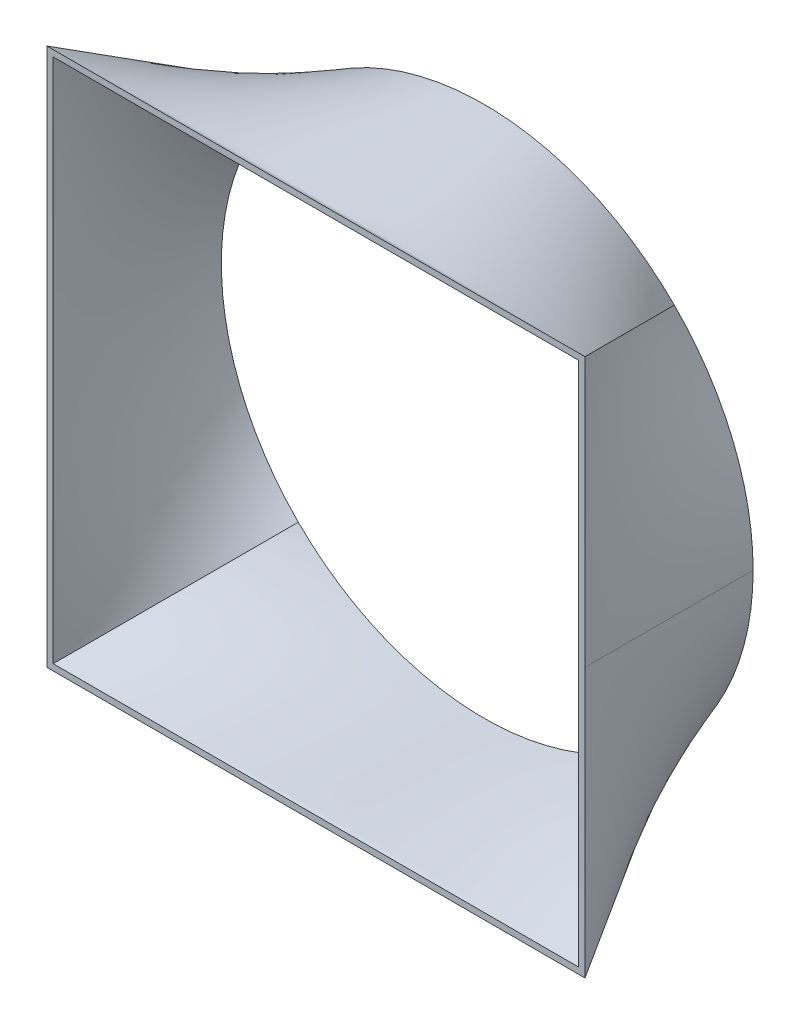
ISO-10303-21;
HEADER;
FILE_DESCRIPTION(('STEP AP214'),'2;1');
FILE_NAME('part.step','',(''),(''),'','','');
FILE_SCHEMA(('AUTOMOTIVE_DESIGN { 1 0 10303 214 1 1 1 1 }'));
ENDSEC;
DATA;
#1=APPLICATION_CONTEXT('core data for automotive mechanical design processes');
#2=APPLICATION_PROTOCOL_DEFINITION('international standard','automotive_design',2000,#1);
#3=PRODUCT_CONTEXT('',#1,'mechanical');
#4=PRODUCT('Part','Part','',(#3));
#5=PRODUCT_RELATED_PRODUCT_CATEGORY('part','',(#4));
#6=PRODUCT_DEFINITION_FORMATION('','',#4);
#7=PRODUCT_DEFINITION_CONTEXT('part definition',#1,'design');
#8=PRODUCT_DEFINITION('design','',#6,#7);
#9=PRODUCT_DEFINITION_SHAPE('','',#8);
#10=(LENGTH_UNIT() NAMED_UNIT(*) SI_UNIT(.MILLI.,.METRE.));
#11=(NAMED_UNIT(*) PLANE_ANGLE_UNIT() SI_UNIT($,.RADIAN.));
#12=(NAMED_UNIT(*) SI_UNIT($,.STERADIAN.) SOLID_ANGLE_UNIT());
#13=UNCERTAINTY_MEASURE_WITH_UNIT(LENGTH_MEASURE(1.E-05),#10,'distance_accuracy_value','');
#14=(GEOMETRIC_REPRESENTATION_CONTEXT(3) GLOBAL_UNCERTAINTY_ASSIGNED_CONTEXT((#13)) GLOBAL_UNIT_ASSIGNED_CONTEXT((#10,
#11,#12)) REPRESENTATION_CONTEXT('',''));
#15=CARTESIAN_POINT('',(0.,0.,0.));
#16=DIRECTION('',(0.,0.,1.));
#17=DIRECTION('',(1.,0.,0.));
#18=AXIS2_PLACEMENT_3D('',#15,#16,#17);
#19=CARTESIAN_POINT('',(88.388347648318,-88.38834764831,0.));
#20=CARTESIAN_POINT('',(125.,-125.,80.));
#21=CARTESIAN_POINT('',(98.30549706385,-78.47119823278,0.));
#22=CARTESIAN_POINT('',(125.,-107.1428571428,80.));
#23=CARTESIAN_POINT('',(106.92449391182,-67.25589665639,0.));
#24=CARTESIAN_POINT('',(125.,-89.28571428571,80.));
#25=CARTESIAN_POINT('',(114.04143049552,-54.94635869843,0.));
#26=CARTESIAN_POINT('',(125.,-71.42857142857,80.));
#27=CARTESIAN_POINT('',(119.49241167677,-41.78652600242,0.));
#28=CARTESIAN_POINT('',(125.,-53.57142857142,80.));
#29=CARTESIAN_POINT('',(123.1641353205,-28.04993411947,0.));
#30=CARTESIAN_POINT('',(125.,-35.71428571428,80.));
#31=CARTESIAN_POINT('',(125.,-14.02496720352,0.));
#32=CARTESIAN_POINT('',(125.,-17.85714285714,80.));
#33=CARTESIAN_POINT('',(125.,0.,0.));
#34=CARTESIAN_POINT('',(125.,0.,80.));
#35=(BOUNDED_SURFACE() B_SPLINE_SURFACE(7,1,((#19,#20),(#21,#22),(#23,#24),(#25,#26),(#27,#28),
(#29,#30),(#31,#32),(#33,#34)),.UNSPECIFIED.,.F.,.F.,.F.) B_SPLINE_SURFACE_WITH_KNOTS((8,8),(2,
2),(0.,125.),(0.,1.),
.UNSPECIFIED.) GEOMETRIC_REPRESENTATION_ITEM() RATIONAL_B_SPLINE_SURFACE(((1.,1.),(1.,1.),(1.,
1.),(1.,1.),(1.,1.),(1.,1.),(1.,1.),(1.,1.))) REPRESENTATION_ITEM('') SURFACE());
#36=CARTESIAN_POINT('',(88.388347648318,-88.38834764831,0.));
#37=CARTESIAN_POINT('',(125.,-125.,80.));
#38=(BOUNDED_CURVE() B_SPLINE_CURVE(1,(#36,#37),.UNSPECIFIED.,.F.,
.F.) B_SPLINE_CURVE_WITH_KNOTS((2,2),(0.,1.),
.UNSPECIFIED.) CURVE() GEOMETRIC_REPRESENTATION_ITEM() RATIONAL_B_SPLINE_CURVE((1.,1.)) REPRESENTATION_ITEM(''));
#39=CARTESIAN_POINT('',(88.388347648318,-88.38834764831,0.));
#40=VERTEX_POINT('',#39);
#41=CARTESIAN_POINT('',(125.,-125.,80.));
#42=VERTEX_POINT('',#41);
#43=EDGE_CURVE('E10',#40,#42,#38,.T.);
#44=DIRECTION('',(0.,1.,0.));
#45=VECTOR('',#44,1.);
#46=CARTESIAN_POINT('',(125.,-125.,80.));
#47=LINE('',#46,#45);
#48=CARTESIAN_POINT('',(125.,0.,80.));
#49=VERTEX_POINT('',#48);
#50=EDGE_CURVE('E139',#42,#49,#47,.T.);
#51=CARTESIAN_POINT('',(125.,0.,0.));
#52=CARTESIAN_POINT('',(125.,0.,80.));
#53=(BOUNDED_CURVE() B_SPLINE_CURVE(1,(#51,#52),.UNSPECIFIED.,.F.,
.F.) B_SPLINE_CURVE_WITH_KNOTS((2,2),(0.,1.),
.UNSPECIFIED.) CURVE() GEOMETRIC_REPRESENTATION_ITEM() RATIONAL_B_SPLINE_CURVE((1.,1.)) REPRESENTATION_ITEM(''));
#54=CARTESIAN_POINT('',(125.,0.,0.));
#55=VERTEX_POINT('',#54);
#56=EDGE_CURVE('E124',#55,#49,#53,.T.);
#57=CARTESIAN_POINT('',(0.,0.,0.));
#58=DIRECTION('',(0.,0.,1.));
#59=DIRECTION('',(1.,0.,0.));
#60=AXIS2_PLACEMENT_3D('',#57,#58,#59);
#61=CIRCLE('',#60,125.);
#62=EDGE_CURVE('E161',#40,#55,#61,.T.);
#63=ORIENTED_EDGE('',*,*,#43,.T.);
#64=ORIENTED_EDGE('',*,*,#50,.T.);
#65=ORIENTED_EDGE('',*,*,#56,.F.);
#66=ORIENTED_EDGE('',*,*,#62,.F.);
#67=EDGE_LOOP('',(#63,#64,#65,#66));
#68=FACE_BOUND('',#67,.T.);
#69=ADVANCED_FACE('F16',(#68),#35,.F.);
#70=CARTESIAN_POINT('',(-88.38834764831,-88.38834764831,0.));
#71=CARTESIAN_POINT('',(-125.,-125.,80.));
#72=CARTESIAN_POINT('',(-72.96167077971,-103.8150245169,0.));
#73=CARTESIAN_POINT('',(-97.22222222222,-125.,80.));
#74=CARTESIAN_POINT('',(-54.50597301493,-116.2126809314,0.));
#75=CARTESIAN_POINT('',(-69.44444444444,-125.,80.));
#76=CARTESIAN_POINT('',(-33.70096481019,-124.9016021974,0.));
#77=CARTESIAN_POINT('',(-41.66666666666,-125.,80.));
#78=CARTESIAN_POINT('',(-11.40430607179,-129.3800423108,0.));
#79=CARTESIAN_POINT('',(-13.88888888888,-125.,80.));
#80=CARTESIAN_POINT('',(11.404306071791,-129.3800423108,0.));
#81=CARTESIAN_POINT('',(13.888888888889,-125.,80.));
#82=CARTESIAN_POINT('',(33.700964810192,-124.9016021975,0.));
#83=CARTESIAN_POINT('',(41.666666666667,-125.,80.));
#84=CARTESIAN_POINT('',(54.505973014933,-116.2126809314,0.));
#85=CARTESIAN_POINT('',(69.444444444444,-125.,80.));
#86=CARTESIAN_POINT('',(72.961670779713,-103.8150245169,0.));
#87=CARTESIAN_POINT('',(97.222222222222,-125.,80.));
#88=CARTESIAN_POINT('',(88.388347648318,-88.38834764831,0.));
#89=CARTESIAN_POINT('',(125.,-125.,80.));
#90=(BOUNDED_SURFACE() B_SPLINE_SURFACE(9,1,((#70,#71),(#72,#73),(#74,#75),(#76,#77),(#78,#79),
(#80,#81),(#82,#83),(#84,#85),(#86,#87),(#88,#89)),.UNSPECIFIED.,.F.,.F.,
.F.) B_SPLINE_SURFACE_WITH_KNOTS((10,10),(2,2),(0.,250.),(0.,1.),
.UNSPECIFIED.) GEOMETRIC_REPRESENTATION_ITEM() RATIONAL_B_SPLINE_SURFACE(((1.,1.),(1.,1.),(1.,
1.),(1.,1.),(1.,1.),(1.,1.),(1.,1.),(1.,1.),(1.,1.),(1.,1.))) REPRESENTATION_ITEM('') SURFACE());
#91=CARTESIAN_POINT('',(-88.38834764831,-88.38834764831,0.));
#92=CARTESIAN_POINT('',(-125.,-125.,80.));
#93=(BOUNDED_CURVE() B_SPLINE_CURVE(1,(#91,#92),.UNSPECIFIED.,.F.,
.F.) B_SPLINE_CURVE_WITH_KNOTS((2,2),(0.,1.),
.UNSPECIFIED.) CURVE() GEOMETRIC_REPRESENTATION_ITEM() RATIONAL_B_SPLINE_CURVE((1.,1.)) REPRESENTATION_ITEM(''));
#94=CARTESIAN_POINT('',(-88.38834764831,-88.38834764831,0.));
#95=VERTEX_POINT('',#94);
#96=CARTESIAN_POINT('',(-125.,-125.,80.));
#97=VERTEX_POINT('',#96);
#98=EDGE_CURVE('E22',#95,#97,#93,.T.);
#99=DIRECTION('',(1.,0.,0.));
#100=VECTOR('',#99,1.);
#101=CARTESIAN_POINT('',(-125.,-125.,80.));
#102=LINE('',#101,#100);
#103=EDGE_CURVE('E143',#97,#42,#102,.T.);
#104=CARTESIAN_POINT('',(0.,0.,0.));
#105=DIRECTION('',(0.,0.,1.));
#106=DIRECTION('',(1.,0.,0.));
#107=AXIS2_PLACEMENT_3D('',#104,#105,#106);
#108=CIRCLE('',#107,125.);
#109=EDGE_CURVE('E211',#95,#40,#108,.T.);
#110=ORIENTED_EDGE('',*,*,#98,.T.);
#111=ORIENTED_EDGE('',*,*,#103,.T.);
#112=ORIENTED_EDGE('',*,*,#43,.F.);
#113=ORIENTED_EDGE('',*,*,#109,.F.);
#114=EDGE_LOOP('',(#110,#111,#112,#113));
#115=FACE_BOUND('',#114,.T.);
#116=ADVANCED_FACE('F18',(#115),#90,.F.);
#117=CARTESIAN_POINT('',(-88.38834764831,88.388347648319,0.));
#118=CARTESIAN_POINT('',(-125.,125.,80.));
#119=CARTESIAN_POINT('',(-103.8150245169,72.961670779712,0.));
#120=CARTESIAN_POINT('',(-125.,97.222222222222,80.));
#121=CARTESIAN_POINT('',(-116.2126809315,54.505973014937,0.));
#122=CARTESIAN_POINT('',(-125.,69.444444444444,80.));
#123=CARTESIAN_POINT('',(-124.9016021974,33.700964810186,0.));
#124=CARTESIAN_POINT('',(-125.,41.666666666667,80.));
#125=CARTESIAN_POINT('',(-129.3800423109,11.404306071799,0.));
#126=CARTESIAN_POINT('',(-125.,13.888888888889,80.));
#127=CARTESIAN_POINT('',(-129.3800423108,-11.40430607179,0.));
#128=CARTESIAN_POINT('',(-125.,-13.88888888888,80.));
#129=CARTESIAN_POINT('',(-124.9016021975,-33.70096481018,0.));
#130=CARTESIAN_POINT('',(-125.,-41.66666666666,80.));
#131=CARTESIAN_POINT('',(-116.2126809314,-54.50597301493,0.));
#132=CARTESIAN_POINT('',(-125.,-69.44444444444,80.));
#133=CARTESIAN_POINT('',(-103.8150245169,-72.96167077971,0.));
#134=CARTESIAN_POINT('',(-125.,-97.22222222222,80.));
#135=CARTESIAN_POINT('',(-88.38834764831,-88.38834764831,0.));
#136=CARTESIAN_POINT('',(-125.,-125.,80.));
#137=(BOUNDED_SURFACE() B_SPLINE_SURFACE(9,1,((#117,#118),(#119,#120),(#121,#122),(#123,#124),
(#125,#126),(#127,#128),(#129,#130),(#131,#132),(#133,#134),(#135,#136)),.UNSPECIFIED.,.F.,.F.,
.F.) B_SPLINE_SURFACE_WITH_KNOTS((10,10),(2,2),(0.,250.),(0.,1.),
.UNSPECIFIED.) GEOMETRIC_REPRESENTATION_ITEM() RATIONAL_B_SPLINE_SURFACE(((1.,1.),(1.,1.),(1.,
1.),(1.,1.),(1.,1.),(1.,1.),(1.,1.),(1.,1.),(1.,1.),(1.,1.))) REPRESENTATION_ITEM('') SURFACE());
#138=CARTESIAN_POINT('',(-88.38834764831,88.388347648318,0.));
#139=CARTESIAN_POINT('',(-125.,125.,80.));
#140=(BOUNDED_CURVE() B_SPLINE_CURVE(1,(#138,#139),.UNSPECIFIED.,.F.,
.F.) B_SPLINE_CURVE_WITH_KNOTS((2,2),(0.,1.),
.UNSPECIFIED.) CURVE() GEOMETRIC_REPRESENTATION_ITEM() RATIONAL_B_SPLINE_CURVE((1.,1.)) REPRESENTATION_ITEM(''));
#141=CARTESIAN_POINT('',(-88.38834764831,88.388347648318,0.));
#142=VERTEX_POINT('',#141);
#143=CARTESIAN_POINT('',(-125.,125.,80.));
#144=VERTEX_POINT('',#143);
#145=EDGE_CURVE('E42',#142,#144,#140,.T.);
#146=DIRECTION('',(0.,-1.,0.));
#147=VECTOR('',#146,1.);
#148=CARTESIAN_POINT('',(-125.,125.,80.));
#149=LINE('',#148,#147);
#150=EDGE_CURVE('E217',#144,#97,#149,.T.);
#151=CARTESIAN_POINT('',(0.,0.,0.));
#152=DIRECTION('',(0.,0.,1.));
#153=DIRECTION('',(1.,0.,0.));
#154=AXIS2_PLACEMENT_3D('',#151,#152,#153);
#155=CIRCLE('',#154,125.);
#156=EDGE_CURVE('E204',#142,#95,#155,.T.);
#157=ORIENTED_EDGE('',*,*,#145,.T.);
#158=ORIENTED_EDGE('',*,*,#150,.T.);
#159=ORIENTED_EDGE('',*,*,#98,.F.);
#160=ORIENTED_EDGE('',*,*,#156,.F.);
#161=EDGE_LOOP('',(#157,#158,#159,#160));
#162=FACE_BOUND('',#161,.T.);
#163=ADVANCED_FACE('F322',(#162),#137,.F.);
#164=CARTESIAN_POINT('',(88.388347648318,88.388347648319,0.));
#165=CARTESIAN_POINT('',(125.,125.,80.));
#166=CARTESIAN_POINT('',(72.961670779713,103.81502451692,0.));
#167=CARTESIAN_POINT('',(97.222222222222,125.,80.));
#168=CARTESIAN_POINT('',(54.505973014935,116.2126809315,0.));
#169=CARTESIAN_POINT('',(69.444444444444,125.,80.));
#170=CARTESIAN_POINT('',(33.700964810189,124.90160219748,0.));
#171=CARTESIAN_POINT('',(41.666666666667,125.,80.));
#172=CARTESIAN_POINT('',(11.404306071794,129.3800423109,0.));
#173=CARTESIAN_POINT('',(13.888888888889,125.,80.));
#174=CARTESIAN_POINT('',(-11.40430607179,129.38004231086,0.));
#175=CARTESIAN_POINT('',(-13.88888888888,125.,80.));
#176=CARTESIAN_POINT('',(-33.70096481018,124.90160219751,0.));
#177=CARTESIAN_POINT('',(-41.66666666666,125.,80.));
#178=CARTESIAN_POINT('',(-54.50597301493,116.21268093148,0.));
#179=CARTESIAN_POINT('',(-69.44444444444,125.,80.));
#180=CARTESIAN_POINT('',(-72.96167077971,103.81502451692,0.));
#181=CARTESIAN_POINT('',(-97.22222222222,125.,80.));
#182=CARTESIAN_POINT('',(-88.38834764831,88.388347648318,0.));
#183=CARTESIAN_POINT('',(-125.,125.,80.));
#184=(BOUNDED_SURFACE() B_SPLINE_SURFACE(9,1,((#164,#165),(#166,#167),(#168,#169),(#170,#171),
(#172,#173),(#174,#175),(#176,#177),(#178,#179),(#180,#181),(#182,#183)),.UNSPECIFIED.,.F.,.F.,
.F.) B_SPLINE_SURFACE_WITH_KNOTS((10,10),(2,2),(0.,250.),(0.,1.),
.UNSPECIFIED.) GEOMETRIC_REPRESENTATION_ITEM() RATIONAL_B_SPLINE_SURFACE(((1.,1.),(1.,1.),(1.,
1.),(1.,1.),(1.,1.),(1.,1.),(1.,1.),(1.,1.),(1.,1.),(1.,1.))) REPRESENTATION_ITEM('') SURFACE());
#185=CARTESIAN_POINT('',(88.388347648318,88.388347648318,0.));
#186=CARTESIAN_POINT('',(125.,125.,80.));
#187=(BOUNDED_CURVE() B_SPLINE_CURVE(1,(#185,#186),.UNSPECIFIED.,.F.,
.F.) B_SPLINE_CURVE_WITH_KNOTS((2,2),(0.,1.),
.UNSPECIFIED.) CURVE() GEOMETRIC_REPRESENTATION_ITEM() RATIONAL_B_SPLINE_CURVE((1.,1.)) REPRESENTATION_ITEM(''));
#188=CARTESIAN_POINT('',(88.388347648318,88.388347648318,0.));
#189=VERTEX_POINT('',#188);
#190=CARTESIAN_POINT('',(125.,125.,80.));
#191=VERTEX_POINT('',#190);
#192=EDGE_CURVE('E135',#189,#191,#187,.T.);
#193=DIRECTION('',(-1.,0.,0.));
#194=VECTOR('',#193,1.);
#195=CARTESIAN_POINT('',(125.,125.,80.));
#196=LINE('',#195,#194);
#197=EDGE_CURVE('E149',#191,#144,#196,.T.);
#198=CARTESIAN_POINT('',(0.,0.,0.));
#199=DIRECTION('',(0.,0.,1.));
#200=DIRECTION('',(1.,0.,0.));
#201=AXIS2_PLACEMENT_3D('',#198,#199,#200);
#202=CIRCLE('',#201,125.);
#203=EDGE_CURVE('E200',#189,#142,#202,.T.);
#204=ORIENTED_EDGE('',*,*,#192,.T.);
#205=ORIENTED_EDGE('',*,*,#197,.T.);
#206=ORIENTED_EDGE('',*,*,#145,.F.);
#207=ORIENTED_EDGE('',*,*,#203,.F.);
#208=EDGE_LOOP('',(#204,#205,#206,#207));
#209=FACE_BOUND('',#208,.T.);
#210=ADVANCED_FACE('F327',(#209),#184,.F.);
#211=CARTESIAN_POINT('',(125.,0.,0.));
#212=CARTESIAN_POINT('',(125.,0.,80.));
#213=CARTESIAN_POINT('',(125.,14.024967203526,0.));
#214=CARTESIAN_POINT('',(125.,17.857142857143,80.));
#215=CARTESIAN_POINT('',(123.1641353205,28.049934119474,0.));
#216=CARTESIAN_POINT('',(125.,35.714285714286,80.));
#217=CARTESIAN_POINT('',(119.49241167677,41.786526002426,0.));
#218=CARTESIAN_POINT('',(125.,53.571428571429,80.));
#219=CARTESIAN_POINT('',(114.04143049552,54.946358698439,0.));
#220=CARTESIAN_POINT('',(125.,71.428571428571,80.));
#221=CARTESIAN_POINT('',(106.92449391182,67.255896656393,0.));
#222=CARTESIAN_POINT('',(125.,89.285714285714,80.));
#223=CARTESIAN_POINT('',(98.305497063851,78.471198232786,0.));
#224=CARTESIAN_POINT('',(125.,107.14285714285,80.));
#225=CARTESIAN_POINT('',(88.388347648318,88.388347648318,0.));
#226=CARTESIAN_POINT('',(125.,125.,80.));
#227=(BOUNDED_SURFACE() B_SPLINE_SURFACE(7,1,((#211,#212),(#213,#214),(#215,#216),(#217,#218),
(#219,#220),(#221,#222),(#223,#224),(#225,#226)),.UNSPECIFIED.,.F.,.F.,
.F.) B_SPLINE_SURFACE_WITH_KNOTS((8,8),(2,2),(125.,250.),(0.,1.),
.UNSPECIFIED.) GEOMETRIC_REPRESENTATION_ITEM() RATIONAL_B_SPLINE_SURFACE(((1.,1.),(1.,1.),(1.,
1.),(1.,1.),(1.,1.),(1.,1.),(1.,1.),(1.,1.))) REPRESENTATION_ITEM('') SURFACE());
#228=DIRECTION('',(0.,1.,0.));
#229=VECTOR('',#228,1.);
#230=CARTESIAN_POINT('',(125.,-125.,80.));
#231=LINE('',#230,#229);
#232=EDGE_CURVE('E128',#49,#191,#231,.T.);
#233=CARTESIAN_POINT('',(0.,0.,0.));
#234=DIRECTION('',(0.,0.,1.));
#235=DIRECTION('',(1.,0.,0.));
#236=AXIS2_PLACEMENT_3D('',#233,#234,#235);
#237=CIRCLE('',#236,125.);
#238=EDGE_CURVE('E130',#55,#189,#237,.T.);
#239=ORIENTED_EDGE('',*,*,#56,.T.);
#240=ORIENTED_EDGE('',*,*,#232,.T.);
#241=ORIENTED_EDGE('',*,*,#192,.F.);
#242=ORIENTED_EDGE('',*,*,#238,.F.);
#243=EDGE_LOOP('',(#239,#240,#241,#242));
#244=FACE_BOUND('',#243,.T.);
#245=ADVANCED_FACE('F126',(#244),#227,.F.);
#246=CARTESIAN_POINT('',(-90.50966799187,90.509667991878,0.));
#247=CARTESIAN_POINT('',(-128.,128.,80.));
#248=CARTESIAN_POINT('',(-106.3065851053,74.712750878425,0.));
#249=CARTESIAN_POINT('',(-128.,99.555555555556,80.));
#250=CARTESIAN_POINT('',(-119.0017852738,55.814116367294,0.));
#251=CARTESIAN_POINT('',(-128.,71.111111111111,80.));
#252=CARTESIAN_POINT('',(-127.8992406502,34.509787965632,0.));
#253=CARTESIAN_POINT('',(-128.,42.666666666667,80.));
#254=CARTESIAN_POINT('',(-132.4851633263,11.678009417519,0.));
#255=CARTESIAN_POINT('',(-128.,14.222222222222,80.));
#256=CARTESIAN_POINT('',(-132.4851633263,-11.67800941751,0.));
#257=CARTESIAN_POINT('',(-128.,-14.22222222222,80.));
#258=CARTESIAN_POINT('',(-127.8992406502,-34.50978796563,0.));
#259=CARTESIAN_POINT('',(-128.,-42.66666666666,80.));
#260=CARTESIAN_POINT('',(-119.0017852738,-55.81411636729,0.));
#261=CARTESIAN_POINT('',(-128.,-71.11111111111,80.));
#262=CARTESIAN_POINT('',(-106.3065851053,-74.71275087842,0.));
#263=CARTESIAN_POINT('',(-128.,-99.55555555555,80.));
#264=CARTESIAN_POINT('',(-90.50966799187,-90.50966799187,0.));
#265=CARTESIAN_POINT('',(-128.,-128.,80.));
#266=(BOUNDED_SURFACE() B_SPLINE_SURFACE(9,1,((#246,#247),(#248,#249),(#250,#251),(#252,#253),
(#254,#255),(#256,#257),(#258,#259),(#260,#261),(#262,#263),(#264,#265)),.UNSPECIFIED.,.F.,.F.,
.F.) B_SPLINE_SURFACE_WITH_KNOTS((10,10),(2,2),(0.,256.),(0.,1.),
.UNSPECIFIED.) GEOMETRIC_REPRESENTATION_ITEM() RATIONAL_B_SPLINE_SURFACE(((1.,1.),(1.,1.),(1.,
1.),(1.,1.),(1.,1.),(1.,1.),(1.,1.),(1.,1.),(1.,1.),(1.,1.))) REPRESENTATION_ITEM('') SURFACE());
#267=CARTESIAN_POINT('',(0.,0.,0.));
#268=DIRECTION('',(0.,0.,1.));
#269=DIRECTION('',(1.,0.,0.));
#270=AXIS2_PLACEMENT_3D('',#267,#268,#269);
#271=CIRCLE('',#270,128.);
#272=CARTESIAN_POINT('',(-90.50966799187,90.509667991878,0.));
#273=VERTEX_POINT('',#272);
#274=CARTESIAN_POINT('',(-90.50966799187,-90.50966799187,0.));
#275=VERTEX_POINT('',#274);
#276=EDGE_CURVE('E188',#273,#275,#271,.T.);
#277=CARTESIAN_POINT('',(-90.50966799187,-90.50966799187,0.));
#278=CARTESIAN_POINT('',(-128.,-128.,80.));
#279=(BOUNDED_CURVE() B_SPLINE_CURVE(1,(#277,#278),.UNSPECIFIED.,.F.,
.F.) B_SPLINE_CURVE_WITH_KNOTS((2,2),(0.,1.),
.UNSPECIFIED.) CURVE() GEOMETRIC_REPRESENTATION_ITEM() RATIONAL_B_SPLINE_CURVE((1.,1.)) REPRESENTATION_ITEM(''));
#280=CARTESIAN_POINT('',(-128.,-128.,80.));
#281=VERTEX_POINT('',#280);
#282=EDGE_CURVE('E136',#275,#281,#279,.T.);
#283=DIRECTION('',(0.,-1.,0.));
#284=VECTOR('',#283,1.);
#285=CARTESIAN_POINT('',(-128.,128.,80.));
#286=LINE('',#285,#284);
#287=CARTESIAN_POINT('',(-128.,128.,80.));
#288=VERTEX_POINT('',#287);
#289=EDGE_CURVE('E221',#288,#281,#286,.T.);
#290=CARTESIAN_POINT('',(-90.50966799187,90.509667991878,0.));
#291=CARTESIAN_POINT('',(-128.,128.,80.));
#292=(BOUNDED_CURVE() B_SPLINE_CURVE(1,(#290,#291),.UNSPECIFIED.,.F.,
.F.) B_SPLINE_CURVE_WITH_KNOTS((2,2),(0.,1.),
.UNSPECIFIED.) CURVE() GEOMETRIC_REPRESENTATION_ITEM() RATIONAL_B_SPLINE_CURVE((1.,1.)) REPRESENTATION_ITEM(''));
#293=EDGE_CURVE('E220',#273,#288,#292,.T.);
#294=ORIENTED_EDGE('',*,*,#276,.T.);
#295=ORIENTED_EDGE('',*,*,#282,.T.);
#296=ORIENTED_EDGE('',*,*,#289,.F.);
#297=ORIENTED_EDGE('',*,*,#293,.F.);
#298=EDGE_LOOP('',(#294,#295,#296,#297));
#299=FACE_BOUND('',#298,.T.);
#300=ADVANCED_FACE('F342',(#299),#266,.T.);
#301=CARTESIAN_POINT('',(-90.50966799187,-90.50966799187,0.));
#302=CARTESIAN_POINT('',(-128.,-128.,80.));
#303=CARTESIAN_POINT('',(-74.71275087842,-106.3065851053,0.));
#304=CARTESIAN_POINT('',(-99.55555555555,-128.,80.));
#305=CARTESIAN_POINT('',(-55.81411636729,-119.0017852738,0.));
#306=CARTESIAN_POINT('',(-71.11111111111,-128.,80.));
#307=CARTESIAN_POINT('',(-34.50978796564,-127.8992406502,0.));
#308=CARTESIAN_POINT('',(-42.66666666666,-128.,80.));
#309=CARTESIAN_POINT('',(-11.6780094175,-132.4851633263,0.));
#310=CARTESIAN_POINT('',(-14.22222222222,-128.,80.));
#311=CARTESIAN_POINT('',(11.678009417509,-132.4851633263,0.));
#312=CARTESIAN_POINT('',(14.222222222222,-128.,80.));
#313=CARTESIAN_POINT('',(34.50978796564,-127.8992406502,0.));
#314=CARTESIAN_POINT('',(42.666666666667,-128.,80.));
#315=CARTESIAN_POINT('',(55.81411636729,-119.0017852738,0.));
#316=CARTESIAN_POINT('',(71.111111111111,-128.,80.));
#317=CARTESIAN_POINT('',(74.712750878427,-106.3065851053,0.));
#318=CARTESIAN_POINT('',(99.555555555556,-128.,80.));
#319=CARTESIAN_POINT('',(90.509667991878,-90.50966799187,0.));
#320=CARTESIAN_POINT('',(128.,-128.,80.));
#321=(BOUNDED_SURFACE() B_SPLINE_SURFACE(9,1,((#301,#302),(#303,#304),(#305,#306),(#307,#308),
(#309,#310),(#311,#312),(#313,#314),(#315,#316),(#317,#318),(#319,#320)),.UNSPECIFIED.,.F.,.F.,
.F.) B_SPLINE_SURFACE_WITH_KNOTS((10,10),(2,2),(0.,256.),(0.,1.),
.UNSPECIFIED.) GEOMETRIC_REPRESENTATION_ITEM() RATIONAL_B_SPLINE_SURFACE(((1.,1.),(1.,1.),(1.,
1.),(1.,1.),(1.,1.),(1.,1.),(1.,1.),(1.,1.),(1.,1.),(1.,1.))) REPRESENTATION_ITEM('') SURFACE());
#322=CARTESIAN_POINT('',(0.,0.,0.));
#323=DIRECTION('',(0.,0.,1.));
#324=DIRECTION('',(1.,0.,0.));
#325=AXIS2_PLACEMENT_3D('',#322,#323,#324);
#326=CIRCLE('',#325,128.);
#327=CARTESIAN_POINT('',(90.509667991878,-90.50966799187,0.));
#328=VERTEX_POINT('',#327);
#329=EDGE_CURVE('E196',#275,#328,#326,.T.);
#330=CARTESIAN_POINT('',(90.509667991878,-90.50966799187,0.));
#331=CARTESIAN_POINT('',(128.,-128.,80.));
#332=(BOUNDED_CURVE() B_SPLINE_CURVE(1,(#330,#331),.UNSPECIFIED.,.F.,
.F.) B_SPLINE_CURVE_WITH_KNOTS((2,2),(0.,1.),
.UNSPECIFIED.) CURVE() GEOMETRIC_REPRESENTATION_ITEM() RATIONAL_B_SPLINE_CURVE((1.,1.)) REPRESENTATION_ITEM(''));
#333=CARTESIAN_POINT('',(128.,-128.,80.));
#334=VERTEX_POINT('',#333);
#335=EDGE_CURVE('E236',#328,#334,#332,.T.);
#336=DIRECTION('',(1.,0.,0.));
#337=VECTOR('',#336,1.);
#338=CARTESIAN_POINT('',(-128.,-128.,80.));
#339=LINE('',#338,#337);
#340=EDGE_CURVE('E157',#281,#334,#339,.T.);
#341=ORIENTED_EDGE('',*,*,#329,.T.);
#342=ORIENTED_EDGE('',*,*,#335,.T.);
#343=ORIENTED_EDGE('',*,*,#340,.F.);
#344=ORIENTED_EDGE('',*,*,#282,.F.);
#345=EDGE_LOOP('',(#341,#342,#343,#344));
#346=FACE_BOUND('',#345,.T.);
#347=ADVANCED_FACE('F287',(#346),#321,.T.);
#348=CARTESIAN_POINT('',(90.509667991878,-90.50966799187,0.));
#349=CARTESIAN_POINT('',(128.,-128.,80.));
#350=CARTESIAN_POINT('',(100.66482899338,-80.35450699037,0.));
#351=CARTESIAN_POINT('',(128.,-109.7142857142,80.));
#352=CARTESIAN_POINT('',(109.4906817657,-68.87003817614,0.));
#353=CARTESIAN_POINT('',(128.,-91.42857142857,80.));
#354=CARTESIAN_POINT('',(116.77842482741,-56.2650713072,0.));
#355=CARTESIAN_POINT('',(128.,-73.14285714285,80.));
#356=CARTESIAN_POINT('',(122.36022955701,-42.78940262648,0.));
#357=CARTESIAN_POINT('',(128.,-54.85714285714,80.));
#358=CARTESIAN_POINT('',(126.1200745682,-28.72313253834,0.));
#359=CARTESIAN_POINT('',(128.,-36.57142857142,80.));
#360=CARTESIAN_POINT('',(128.,-14.36156641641,0.));
#361=CARTESIAN_POINT('',(128.,-18.28571428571,80.));
#362=CARTESIAN_POINT('',(128.,0.,0.));
#363=CARTESIAN_POINT('',(128.,0.,80.));
#364=(BOUNDED_SURFACE() B_SPLINE_SURFACE(7,1,((#348,#349),(#350,#351),(#352,#353),(#354,#355),
(#356,#357),(#358,#359),(#360,#361),(#362,#363)),.UNSPECIFIED.,.F.,.F.,
.F.) B_SPLINE_SURFACE_WITH_KNOTS((8,8),(2,2),(0.,128.),(0.,1.),
.UNSPECIFIED.) GEOMETRIC_REPRESENTATION_ITEM() RATIONAL_B_SPLINE_SURFACE(((1.,1.),(1.,1.),(1.,
1.),(1.,1.),(1.,1.),(1.,1.),(1.,1.),(1.,1.))) REPRESENTATION_ITEM('') SURFACE());
#365=CARTESIAN_POINT('',(0.,0.,0.));
#366=DIRECTION('',(0.,0.,1.));
#367=DIRECTION('',(1.,0.,0.));
#368=AXIS2_PLACEMENT_3D('',#365,#366,#367);
#369=CIRCLE('',#368,128.);
#370=CARTESIAN_POINT('',(128.,0.,0.));
#371=VERTEX_POINT('',#370);
#372=EDGE_CURVE('E187',#328,#371,#369,.T.);
#373=CARTESIAN_POINT('',(128.,0.,0.));
#374=CARTESIAN_POINT('',(128.,0.,80.));
#375=(BOUNDED_CURVE() B_SPLINE_CURVE(1,(#373,#374),.UNSPECIFIED.,.F.,
.F.) B_SPLINE_CURVE_WITH_KNOTS((2,2),(0.,1.),
.UNSPECIFIED.) CURVE() GEOMETRIC_REPRESENTATION_ITEM() RATIONAL_B_SPLINE_CURVE((1.,1.)) REPRESENTATION_ITEM(''));
#376=CARTESIAN_POINT('',(128.,0.,80.));
#377=VERTEX_POINT('',#376);
#378=EDGE_CURVE('E180',#371,#377,#375,.T.);
#379=DIRECTION('',(0.,1.,0.));
#380=VECTOR('',#379,1.);
#381=CARTESIAN_POINT('',(128.,-128.,80.));
#382=LINE('',#381,#380);
#383=EDGE_CURVE('E151',#334,#377,#382,.T.);
#384=ORIENTED_EDGE('',*,*,#372,.T.);
#385=ORIENTED_EDGE('',*,*,#378,.T.);
#386=ORIENTED_EDGE('',*,*,#383,.F.);
#387=ORIENTED_EDGE('',*,*,#335,.F.);
#388=EDGE_LOOP('',(#384,#385,#386,#387));
#389=FACE_BOUND('',#388,.T.);
#390=ADVANCED_FACE('F282',(#389),#364,.T.);
#391=CARTESIAN_POINT('',(128.,0.,80.));
#392=DIRECTION('',(0.,0.,1.));
#393=DIRECTION('',(1.,0.,0.));
#394=AXIS2_PLACEMENT_3D('',#391,#392,#393);
#395=PLANE('',#394);
#396=ORIENTED_EDGE('',*,*,#232,.F.);
#397=ORIENTED_EDGE('',*,*,#50,.F.);
#398=ORIENTED_EDGE('',*,*,#103,.F.);
#399=ORIENTED_EDGE('',*,*,#150,.F.);
#400=ORIENTED_EDGE('',*,*,#197,.F.);
#401=EDGE_LOOP('',(#396,#397,#398,#399,#400));
#402=FACE_BOUND('',#401,.T.);
#403=DIRECTION('',(0.,1.,0.));
#404=VECTOR('',#403,1.);
#405=CARTESIAN_POINT('',(128.,-128.,80.));
#406=LINE('',#405,#404);
#407=CARTESIAN_POINT('',(128.,128.,80.));
#408=VERTEX_POINT('',#407);
#409=EDGE_CURVE('E167',#377,#408,#406,.T.);
#410=ORIENTED_EDGE('',*,*,#409,.T.);
#411=DIRECTION('',(-1.,0.,0.));
#412=VECTOR('',#411,1.);
#413=CARTESIAN_POINT('',(128.,128.,80.));
#414=LINE('',#413,#412);
#415=EDGE_CURVE('E225',#408,#288,#414,.T.);
#416=ORIENTED_EDGE('',*,*,#415,.T.);
#417=ORIENTED_EDGE('',*,*,#289,.T.);
#418=ORIENTED_EDGE('',*,*,#340,.T.);
#419=ORIENTED_EDGE('',*,*,#383,.T.);
#420=EDGE_LOOP('',(#410,#416,#417,#418,#419));
#421=FACE_BOUND('',#420,.T.);
#422=ADVANCED_FACE('F146',(#402,#421),#395,.T.);
#423=CARTESIAN_POINT('',(90.509667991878,90.509667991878,0.));
#424=CARTESIAN_POINT('',(128.,128.,80.));
#425=CARTESIAN_POINT('',(74.712750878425,106.30658510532,0.));
#426=CARTESIAN_POINT('',(99.555555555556,128.,80.));
#427=CARTESIAN_POINT('',(55.814116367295,119.00178527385,0.));
#428=CARTESIAN_POINT('',(71.111111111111,128.,80.));
#429=CARTESIAN_POINT('',(34.50978796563,127.89924065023,0.));
#430=CARTESIAN_POINT('',(42.666666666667,128.,80.));
#431=CARTESIAN_POINT('',(11.678009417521,132.48516332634,0.));
#432=CARTESIAN_POINT('',(14.222222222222,128.,80.));
#433=CARTESIAN_POINT('',(-11.67800941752,132.48516332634,0.));
#434=CARTESIAN_POINT('',(-14.22222222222,128.,80.));
#435=CARTESIAN_POINT('',(-34.50978796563,127.89924065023,0.));
#436=CARTESIAN_POINT('',(-42.66666666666,128.,80.));
#437=CARTESIAN_POINT('',(-55.81411636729,119.00178527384,0.));
#438=CARTESIAN_POINT('',(-71.11111111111,128.,80.));
#439=CARTESIAN_POINT('',(-74.71275087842,106.30658510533,0.));
#440=CARTESIAN_POINT('',(-99.55555555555,128.,80.));
#441=CARTESIAN_POINT('',(-90.50966799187,90.509667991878,0.));
#442=CARTESIAN_POINT('',(-128.,128.,80.));
#443=(BOUNDED_SURFACE() B_SPLINE_SURFACE(9,1,((#423,#424),(#425,#426),(#427,#428),(#429,#430),
(#431,#432),(#433,#434),(#435,#436),(#437,#438),(#439,#440),(#441,#442)),.UNSPECIFIED.,.F.,.F.,
.F.) B_SPLINE_SURFACE_WITH_KNOTS((10,10),(2,2),(0.,256.),(0.,1.),
.UNSPECIFIED.) GEOMETRIC_REPRESENTATION_ITEM() RATIONAL_B_SPLINE_SURFACE(((1.,1.),(1.,1.),(1.,
1.),(1.,1.),(1.,1.),(1.,1.),(1.,1.),(1.,1.),(1.,1.),(1.,1.))) REPRESENTATION_ITEM('') SURFACE());
#444=CARTESIAN_POINT('',(0.,0.,0.));
#445=DIRECTION('',(0.,0.,1.));
#446=DIRECTION('',(1.,0.,0.));
#447=AXIS2_PLACEMENT_3D('',#444,#445,#446);
#448=CIRCLE('',#447,128.);
#449=CARTESIAN_POINT('',(90.509667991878,90.509667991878,0.));
#450=VERTEX_POINT('',#449);
#451=EDGE_CURVE('E195',#450,#273,#448,.T.);
#452=CARTESIAN_POINT('',(90.509667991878,90.509667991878,0.));
#453=CARTESIAN_POINT('',(128.,128.,80.));
#454=(BOUNDED_CURVE() B_SPLINE_CURVE(1,(#452,#453),.UNSPECIFIED.,.F.,
.F.) B_SPLINE_CURVE_WITH_KNOTS((2,2),(0.,1.),
.UNSPECIFIED.) CURVE() GEOMETRIC_REPRESENTATION_ITEM() RATIONAL_B_SPLINE_CURVE((1.,1.)) REPRESENTATION_ITEM(''));
#455=EDGE_CURVE('E163',#450,#408,#454,.T.);
#456=ORIENTED_EDGE('',*,*,#451,.T.);
#457=ORIENTED_EDGE('',*,*,#293,.T.);
#458=ORIENTED_EDGE('',*,*,#415,.F.);
#459=ORIENTED_EDGE('',*,*,#455,.F.);
#460=EDGE_LOOP('',(#456,#457,#458,#459));
#461=FACE_BOUND('',#460,.T.);
#462=ADVANCED_FACE('F295',(#461),#443,.T.);
#463=CARTESIAN_POINT('',(0.,0.,0.));
#464=DIRECTION('',(0.,0.,1.));
#465=DIRECTION('',(1.,0.,0.));
#466=AXIS2_PLACEMENT_3D('',#463,#464,#465);
#467=PLANE('',#466);
#468=ORIENTED_EDGE('',*,*,#203,.T.);
#469=ORIENTED_EDGE('',*,*,#156,.T.);
#470=ORIENTED_EDGE('',*,*,#109,.T.);
#471=ORIENTED_EDGE('',*,*,#62,.T.);
#472=ORIENTED_EDGE('',*,*,#238,.T.);
#473=EDGE_LOOP('',(#468,#469,#470,#471,#472));
#474=FACE_BOUND('',#473,.T.);
#475=ORIENTED_EDGE('',*,*,#372,.F.);
#476=ORIENTED_EDGE('',*,*,#329,.F.);
#477=ORIENTED_EDGE('',*,*,#276,.F.);
#478=ORIENTED_EDGE('',*,*,#451,.F.);
#479=CARTESIAN_POINT('',(0.,0.,0.));
#480=DIRECTION('',(0.,0.,1.));
#481=DIRECTION('',(1.,0.,0.));
#482=AXIS2_PLACEMENT_3D('',#479,#480,#481);
#483=CIRCLE('',#482,128.);
#484=EDGE_CURVE('E168',#371,#450,#483,.T.);
#485=ORIENTED_EDGE('',*,*,#484,.F.);
#486=EDGE_LOOP('',(#475,#476,#477,#478,#485));
#487=FACE_BOUND('',#486,.T.);
#488=ADVANCED_FACE('F300',(#474,#487),#467,.F.);
#489=CARTESIAN_POINT('',(128.,0.,0.));
#490=CARTESIAN_POINT('',(128.,0.,80.));
#491=CARTESIAN_POINT('',(128.,14.361566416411,0.));
#492=CARTESIAN_POINT('',(128.,18.285714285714,80.));
#493=CARTESIAN_POINT('',(126.12007456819,28.723132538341,0.));
#494=CARTESIAN_POINT('',(128.,36.571428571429,80.));
#495=CARTESIAN_POINT('',(122.36022955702,42.789402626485,0.));
#496=CARTESIAN_POINT('',(128.,54.857142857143,80.));
#497=CARTESIAN_POINT('',(116.77842482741,56.265071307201,0.));
#498=CARTESIAN_POINT('',(128.,73.142857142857,80.));
#499=CARTESIAN_POINT('',(109.49068176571,68.870038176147,0.));
#500=CARTESIAN_POINT('',(128.,91.428571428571,80.));
#501=CARTESIAN_POINT('',(100.66482899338,80.354506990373,0.));
#502=CARTESIAN_POINT('',(128.,109.71428571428,80.));
#503=CARTESIAN_POINT('',(90.509667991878,90.509667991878,0.));
#504=CARTESIAN_POINT('',(128.,128.,80.));
#505=(BOUNDED_SURFACE() B_SPLINE_SURFACE(7,1,((#489,#490),(#491,#492),(#493,#494),(#495,#496),
(#497,#498),(#499,#500),(#501,#502),(#503,#504)),.UNSPECIFIED.,.F.,.F.,
.F.) B_SPLINE_SURFACE_WITH_KNOTS((8,8),(2,2),(128.,256.),(0.,1.),
.UNSPECIFIED.) GEOMETRIC_REPRESENTATION_ITEM() RATIONAL_B_SPLINE_SURFACE(((1.,1.),(1.,1.),(1.,
1.),(1.,1.),(1.,1.),(1.,1.),(1.,1.),(1.,1.))) REPRESENTATION_ITEM('') SURFACE());
#506=ORIENTED_EDGE('',*,*,#484,.T.);
#507=ORIENTED_EDGE('',*,*,#455,.T.);
#508=ORIENTED_EDGE('',*,*,#409,.F.);
#509=ORIENTED_EDGE('',*,*,#378,.F.);
#510=EDGE_LOOP('',(#506,#507,#508,#509));
#511=FACE_BOUND('',#510,.T.);
#512=ADVANCED_FACE('F306',(#511),#505,.T.);
#513=CLOSED_SHELL('',(#69,#116,#163,#210,#245,#300,#347,#390,#422,#462,#488,#512));
#514=MANIFOLD_SOLID_BREP('B1',#513);
#515=ADVANCED_BREP_SHAPE_REPRESENTATION('',(#18,#514),#14);
#516=SHAPE_DEFINITION_REPRESENTATION(#9,#515);
ENDSEC;
END-ISO-10303-21;
